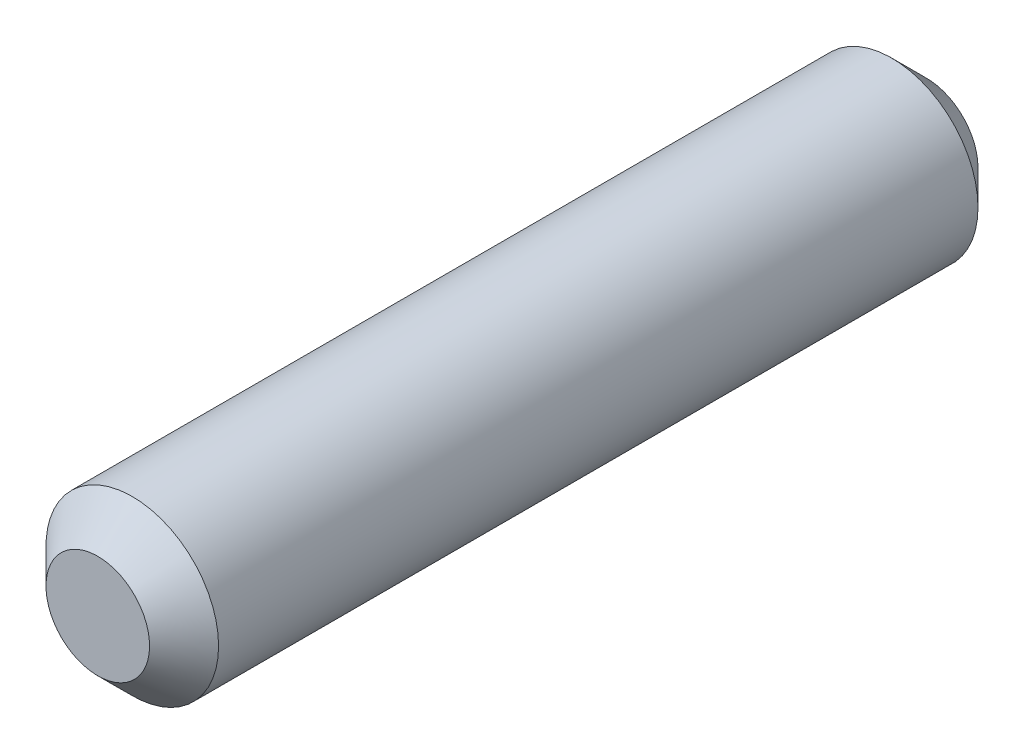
ISO-10303-21;
HEADER;
FILE_DESCRIPTION(('STEP AP214'),'2;1');
FILE_NAME('part.step','',(''),(''),'','','');
FILE_SCHEMA(('AUTOMOTIVE_DESIGN { 1 0 10303 214 1 1 1 1 }'));
ENDSEC;
DATA;
#1=APPLICATION_CONTEXT('core data for automotive mechanical design processes');
#2=APPLICATION_PROTOCOL_DEFINITION('international standard','automotive_design',2000,#1);
#3=PRODUCT_CONTEXT('',#1,'mechanical');
#4=PRODUCT('Part','Part','',(#3));
#5=PRODUCT_RELATED_PRODUCT_CATEGORY('part','',(#4));
#6=PRODUCT_DEFINITION_FORMATION('','',#4);
#7=PRODUCT_DEFINITION_CONTEXT('part definition',#1,'design');
#8=PRODUCT_DEFINITION('design','',#6,#7);
#9=PRODUCT_DEFINITION_SHAPE('','',#8);
#10=(LENGTH_UNIT() NAMED_UNIT(*) SI_UNIT(.MILLI.,.METRE.));
#11=(NAMED_UNIT(*) PLANE_ANGLE_UNIT() SI_UNIT($,.RADIAN.));
#12=(NAMED_UNIT(*) SI_UNIT($,.STERADIAN.) SOLID_ANGLE_UNIT());
#13=UNCERTAINTY_MEASURE_WITH_UNIT(LENGTH_MEASURE(1.E-05),#10,'distance_accuracy_value','');
#14=(GEOMETRIC_REPRESENTATION_CONTEXT(3) GLOBAL_UNCERTAINTY_ASSIGNED_CONTEXT((#13)) GLOBAL_UNIT_ASSIGNED_CONTEXT((#10,
#11,#12)) REPRESENTATION_CONTEXT('',''));
#15=CARTESIAN_POINT('',(0.,0.,0.));
#16=DIRECTION('',(0.,0.,1.));
#17=DIRECTION('',(1.,0.,0.));
#18=AXIS2_PLACEMENT_3D('',#15,#16,#17);
#19=CARTESIAN_POINT('',(0.,0.,24.));
#20=DIRECTION('',(0.,0.,-1.));
#21=DIRECTION('',(-1.,0.,0.));
#22=AXIS2_PLACEMENT_3D('',#19,#20,#21);
#23=CYLINDRICAL_SURFACE('',#22,2.5);
#24=CARTESIAN_POINT('',(0.,0.,23.));
#25=DIRECTION('',(0.,0.,1.));
#26=DIRECTION('',(1.,0.,0.));
#27=AXIS2_PLACEMENT_3D('',#24,#25,#26);
#28=CIRCLE('',#27,2.5);
#29=CARTESIAN_POINT('',(2.5,0.,23.));
#30=VERTEX_POINT('',#29);
#31=EDGE_CURVE('E36',#30,#30,#28,.F.);
#32=ORIENTED_EDGE('',*,*,#31,.T.);
#33=EDGE_LOOP('',(#32));
#34=FACE_BOUND('',#33,.T.);
#35=CARTESIAN_POINT('',(0.,0.,1.00000000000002));
#36=DIRECTION('',(0.,0.,1.));
#37=DIRECTION('',(1.,0.,0.));
#38=AXIS2_PLACEMENT_3D('',#35,#36,#37);
#39=CIRCLE('',#38,2.5);
#40=CARTESIAN_POINT('',(2.5,0.,1.00000000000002));
#41=VERTEX_POINT('',#40);
#42=EDGE_CURVE('E40',#41,#41,#39,.T.);
#43=ORIENTED_EDGE('',*,*,#42,.T.);
#44=EDGE_LOOP('',(#43));
#45=FACE_BOUND('',#44,.T.);
#46=ADVANCED_FACE('F30',(#34,#45),#23,.T.);
#47=CARTESIAN_POINT('',(0.,0.,24.));
#48=DIRECTION('',(0.,0.,1.));
#49=DIRECTION('',(1.,0.,0.));
#50=AXIS2_PLACEMENT_3D('',#47,#48,#49);
#51=PLANE('',#50);
#52=CARTESIAN_POINT('',(0.,0.,24.));
#53=DIRECTION('',(0.,0.,1.));
#54=DIRECTION('',(1.,0.,0.));
#55=AXIS2_PLACEMENT_3D('',#52,#53,#54);
#56=CIRCLE('',#55,1.5);
#57=CARTESIAN_POINT('',(1.5,0.,24.));
#58=VERTEX_POINT('',#57);
#59=EDGE_CURVE('E44',#58,#58,#56,.T.);
#60=ORIENTED_EDGE('',*,*,#59,.T.);
#61=EDGE_LOOP('',(#60));
#62=FACE_BOUND('',#61,.T.);
#63=ADVANCED_FACE('F50',(#62),#51,.T.);
#64=CARTESIAN_POINT('',(0.,0.,0.));
#65=DIRECTION('',(0.,0.,1.));
#66=DIRECTION('',(1.,0.,0.));
#67=AXIS2_PLACEMENT_3D('',#64,#65,#66);
#68=PLANE('',#67);
#69=CARTESIAN_POINT('',(0.,0.,0.));
#70=DIRECTION('',(0.,0.,1.));
#71=DIRECTION('',(1.,0.,0.));
#72=AXIS2_PLACEMENT_3D('',#69,#70,#71);
#73=CIRCLE('',#72,1.5);
#74=CARTESIAN_POINT('',(1.5,0.,0.));
#75=VERTEX_POINT('',#74);
#76=EDGE_CURVE('E10',#75,#75,#73,.F.);
#77=ORIENTED_EDGE('',*,*,#76,.T.);
#78=EDGE_LOOP('',(#77));
#79=FACE_BOUND('',#78,.T.);
#80=ADVANCED_FACE('F55',(#79),#68,.F.);
#81=CARTESIAN_POINT('',(0.,0.,24.));
#82=DIRECTION('',(0.,0.,-1.));
#83=DIRECTION('',(-1.,0.,0.));
#84=AXIS2_PLACEMENT_3D('',#81,#82,#83);
#85=CONICAL_SURFACE('',#84,1.5,0.785398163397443);
#86=ORIENTED_EDGE('',*,*,#31,.F.);
#87=EDGE_LOOP('',(#86));
#88=FACE_BOUND('',#87,.T.);
#89=ORIENTED_EDGE('',*,*,#59,.F.);
#90=EDGE_LOOP('',(#89));
#91=FACE_BOUND('',#90,.T.);
#92=ADVANCED_FACE('F52',(#88,#91),#85,.T.);
#93=CARTESIAN_POINT('',(0.,0.,1.00000000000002));
#94=DIRECTION('',(0.,0.,1.));
#95=DIRECTION('',(1.,0.,0.));
#96=AXIS2_PLACEMENT_3D('',#93,#94,#95);
#97=CONICAL_SURFACE('',#96,2.5,0.785398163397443);
#98=ORIENTED_EDGE('',*,*,#76,.F.);
#99=EDGE_LOOP('',(#98));
#100=FACE_BOUND('',#99,.T.);
#101=ORIENTED_EDGE('',*,*,#42,.F.);
#102=EDGE_LOOP('',(#101));
#103=FACE_BOUND('',#102,.T.);
#104=ADVANCED_FACE('F54',(#100,#103),#97,.T.);
#105=CLOSED_SHELL('',(#46,#63,#80,#92,#104));
#106=MANIFOLD_SOLID_BREP('B2',#105);
#107=ADVANCED_BREP_SHAPE_REPRESENTATION('',(#18,#106),#14);
#108=SHAPE_DEFINITION_REPRESENTATION(#9,#107);
ENDSEC;
END-ISO-10303-21;
